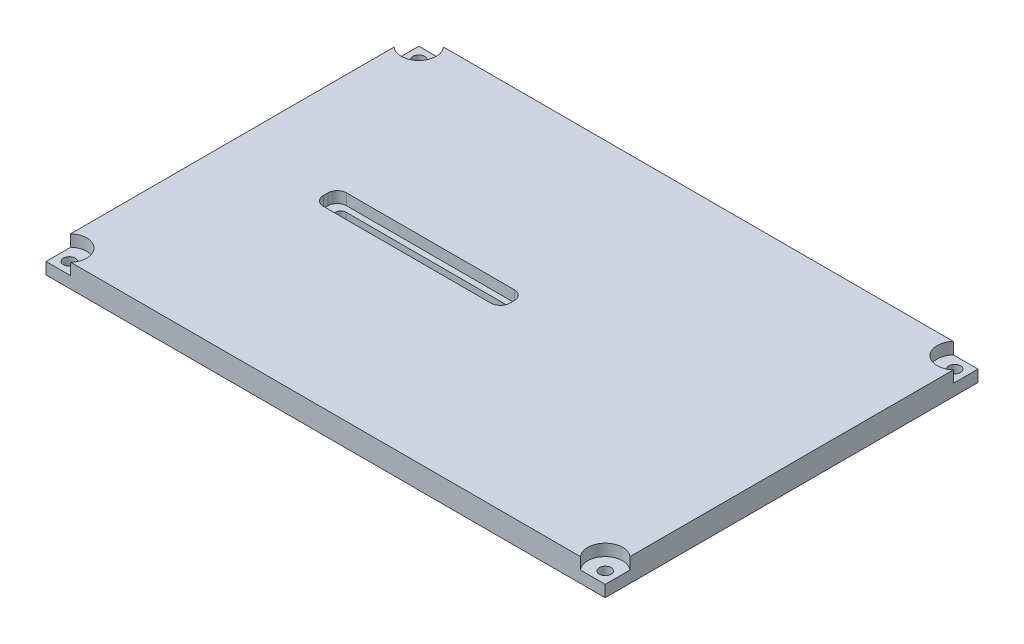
from build123d import *

# Parameters (mm, degrees)
SKETCH1_W                                  = 152.4
SKETCH1_H                                  = 101.6
EXTRUDE1_DEPTH                             = 6.35
SKETCH2_W                                  = 50.8
SKETCH2_H                                  = 6.35
EXTRUDE2_DEPTH                             = 3.048
SKETCH4_W                                  = 45.72
SKETCH4_H                                  = 3.175
EXTRUDE4_DEPTH                             = 92.640510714
FILLET2_R                                  = 1.4351
FILLET3_R                                  = 2.54
CBORE_FOR_4_HEX_MACHINE_SCREW1_D           = 3.175
CBORE_FOR_4_HEX_MACHINE_SCREW1_CBORE_D     = 9.525
CBORE_FOR_4_HEX_MACHINE_SCREW1_CBORE_DEPTH = 3.175
LPATTERN1_COUNT                            = 2
LPATTERN1_PITCH                            = 146.05
LPATTERN1_COUNT_DIR2                       = 2
LPATTERN1_PITCH_DIR2                       = 95.25


with BuildPart() as part:
    # Sketch1 → Extrude1 (new body)
    with BuildSketch(Plane(origin=(0, 0, 0), x_dir=(1, 0, 0), z_dir=(0, 1, 0))):
        Rectangle(SKETCH1_W, SKETCH1_H)
    extrude(amount=EXTRUDE1_DEPTH)

    # Sketch2 → Extrude2 (cut)
    with BuildSketch(Plane(origin=(0, 6.35, 0), x_dir=(-1, 0, 0), z_dir=(0, 1, 0))):
        with Locations((25.4, 0)):
            Rectangle(SKETCH2_W, SKETCH2_H)
    extrude(amount=-EXTRUDE2_DEPTH, mode=Mode.SUBTRACT)

    # Sketch4 → Extrude4 (cut, through all)
    with BuildSketch(Plane(origin=(0, 3.302, 0), x_dir=(1, 0, 0), z_dir=(0, 1, 0))):
        with Locations((-25.4, 0)):
            Rectangle(SKETCH4_W, SKETCH4_H)
    extrude(amount=-EXTRUDE4_DEPTH, mode=Mode.SUBTRACT)

    # Fillet2
    fillet2_edges = [part.edges().sort_by_distance(p)[0] for p in [
        (-2.54, 1.651, 1.5875),
        (-48.26, 1.651, 1.5875),
        (-48.26, 1.651, -1.5875),
        (-2.54, 1.651, -1.5875),
    ]]
    fillet(fillet2_edges, radius=FILLET2_R)

    # Fillet3
    fillet3_edges = [part.edges().sort_by_distance(p)[0] for p in [
        (0, 4.826, -3.175),
        (0, 4.826, 3.175),
        (-50.8, 4.826, 3.175),
        (-50.8, 4.826, -3.175),
    ]]
    fillet(fillet3_edges, radius=FILLET3_R)

    # CBORE for _4 Hex Machine Screw1 (through all)
    with Locations(Plane(origin=(-73.025, 6.35, 47.625), x_dir=(0, 0, 1), z_dir=(0, 1, 0))):
        with Locations((0, 0)):
            cbore_for_4_hex_machine_screw1 = CounterBoreHole(CBORE_FOR_4_HEX_MACHINE_SCREW1_D / 2, CBORE_FOR_4_HEX_MACHINE_SCREW1_CBORE_D / 2, CBORE_FOR_4_HEX_MACHINE_SCREW1_CBORE_DEPTH)

    # LPattern1: CBORE for _4 Hex Machine Screw1 2 × 2
    with Locations(*[(i * LPATTERN1_PITCH, 0, -j * LPATTERN1_PITCH_DIR2) for i in range(LPATTERN1_COUNT) for j in range(LPATTERN1_COUNT_DIR2) if (i, j) != (0, 0)]):
        add(cbore_for_4_hex_machine_screw1, mode=Mode.SUBTRACT)


solid = part.part
